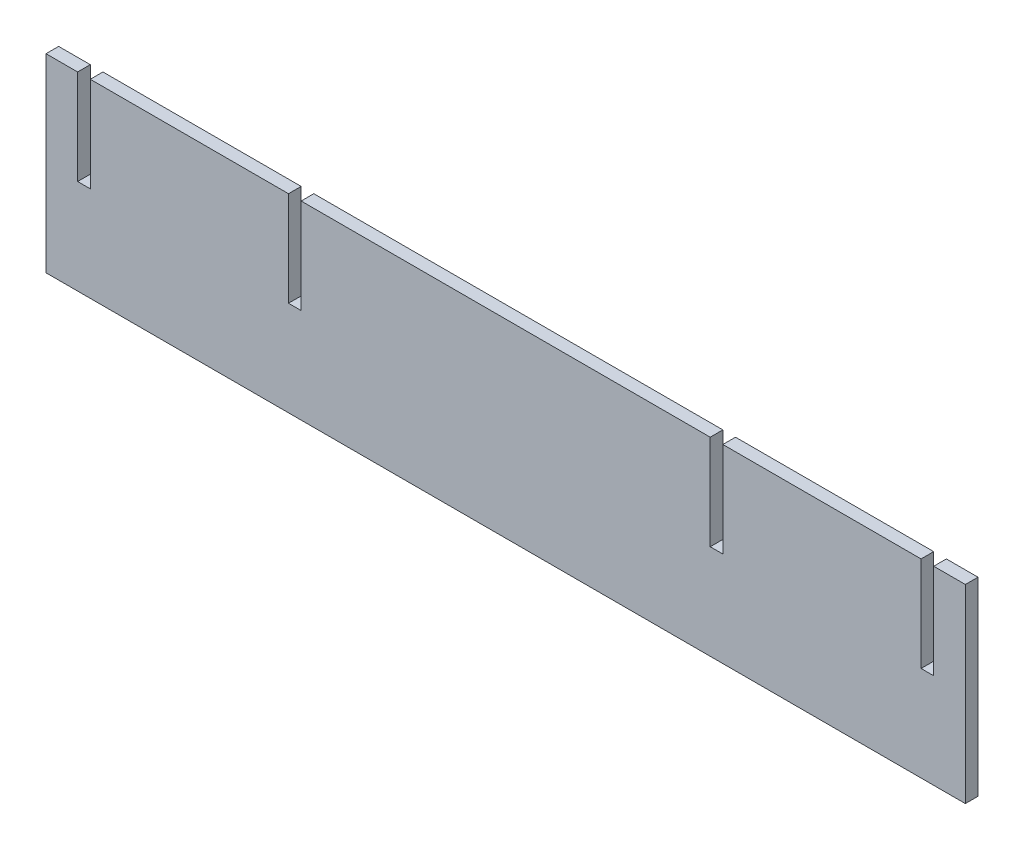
from build123d import *

# Parameters (mm, degrees)
BOSS_EXTRUDE1_DEPTH = 12


with BuildPart() as part:
    # Sketch3 → Boss-Extrude1 (new body)
    with BuildSketch(Plane(origin=(0, 0, 0), x_dir=(0, 1, 0), z_dir=(0, 0, 1))):
        Polygon((0, -194), (90, -194), (90, 194), (0, 194), (0, 206), (90, 206), (90, 394), (0, 394), (0, 406), (90, 406), (90, 436), (-90, 436), (-90, -436), (90, -436), (90, -406), (0, -406), (0, -394), (90, -394), (90, -206), (0, -206), align=None)
    extrude(amount=BOSS_EXTRUDE1_DEPTH)


solid = part.part
